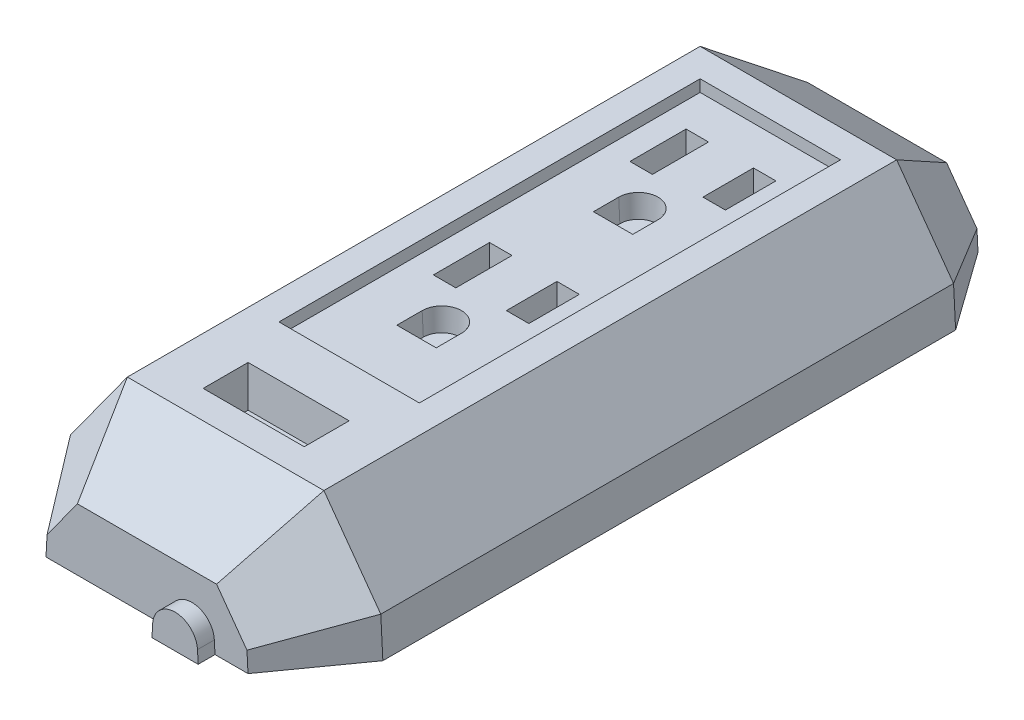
from build123d import *
from OCP.BRepFilletAPI import BRepFilletAPI_MakeChamfer

# Parameters (mm, degrees)
EXTRUDE1_DEPTH               = 130
CHAMFER1_SIZE                = 14
CHAMFER1_SIZE2               = 10
CHAMFER2_SIZE                = 10
CHAMFER2_SIZE2               = 14
EXTRUDE2_DEPTH               = 3
SKETCH3_W                    = 25
SKETCH3_H                    = 75
CUT_EXTRUDE1_DEPTH           = 2
CUT_EXTRUDE1_DRAFT           = -3
SKETCH4_W                    = 4
SKETCH4_H                    = 9
CUT_EXTRUDE2_DEPTH           = 4
CUT_EXTRUDE2_DRAFT           = -3
SKETCH4_H_2                  = 10
CUT_EXTRUDE2_PROFILE_2_DEPTH = 4
CUT_EXTRUDE2_PROFILE_2_DRAFT = -3
CUT_EXTRUDE2_PROFILE_3_DEPTH = 4
CUT_EXTRUDE2_PROFILE_3_DRAFT = -3
LPATTERN1_COPY_1_SKETCH_W    = 4
LPATTERN1_COPY_1_SKETCH_H    = 9
LPATTERN1_COPY_1_DEPTH       = 4
LPATTERN1_COPY_1_DRAFT       = -3
LPATTERN1_COPY_2_SKETCH_W    = 4
LPATTERN1_COPY_2_SKETCH_H    = 10
LPATTERN1_COPY_2_DEPTH       = 4
LPATTERN1_COPY_2_DRAFT       = -3
LPATTERN1_COPY_3_DEPTH       = 4
LPATTERN1_COPY_3_DRAFT       = -3
LPATTERN1_COPY_4_SKETCH_W    = 4
LPATTERN1_COPY_4_SKETCH_H    = 10
LPATTERN1_COPY_4_DEPTH       = 4
LPATTERN1_COPY_4_DRAFT       = -3
LPATTERN1_COPY_5_DEPTH       = 4
LPATTERN1_COPY_5_DRAFT       = -3
SKETCH5_W                    = 18
SKETCH5_H                    = 8
CUT_EXTRUDE3_DEPTH           = 7
CUT_EXTRUDE3_DRAFT           = -3


with BuildPart() as part:
    # Sketch1 → Extrude1 (new body)
    with BuildSketch(Plane.XY):
        Polygon((17.5, 21), (27.633145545, 7), (28, 0), (-28, 0), (-27.633145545, 7), (-17.5, 21), align=None)
    extrude(amount=EXTRUDE1_DEPTH)

    # Chamfer1: one chamfer whose edges measure the first distance from different faces: ONE call of the kernel's chamfer builder (chamfer() names one face for all edges)
    chamfer1_edges_1 = [part.edges().sort_by_distance(p)[0] for p in [
        (0, 21, 130),
    ]]
    chamfer1_side_1 = [part.faces().sort_by_distance(p)[0] for p in [
        (0, 21, 65),
    ]]
    chamfer1_edges_2 = [part.edges().sort_by_distance(p)[0] for p in [
        (-22.566572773, 14, 130),
    ]]
    chamfer1_side_2 = [part.faces().sort_by_distance(p)[0] for p in [
        (-22.566572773, 14, 65),
    ]]
    chamfer1_edges_3 = [part.edges().sort_by_distance(p)[0] for p in [
        (-27.816572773, 3.5, 130),
    ]]
    chamfer1_side_3 = [part.faces().sort_by_distance(p)[0] for p in [
        (-27.816572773, 3.5, 65),
    ]]
    chamfer1_edges_4 = [part.edges().sort_by_distance(p)[0] for p in [
        (27.816572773, 3.5, 130),
    ]]
    chamfer1_side_4 = [part.faces().sort_by_distance(p)[0] for p in [
        (27.816572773, 3.5, 65),
    ]]
    chamfer1_edges_5 = [part.edges().sort_by_distance(p)[0] for p in [
        (22.566572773, 14, 130),
    ]]
    chamfer1_side_5 = [part.faces().sort_by_distance(p)[0] for p in [
        (22.566572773, 14, 65),
    ]]
    chamfer1 = BRepFilletAPI_MakeChamfer(part.part.solid().wrapped)
    for e in chamfer1_edges_1:
        chamfer1.Add(CHAMFER1_SIZE, CHAMFER1_SIZE2, e.wrapped, chamfer1_side_1[0].wrapped)  # the first distance lies on this face
    for e in chamfer1_edges_2:
        chamfer1.Add(CHAMFER1_SIZE, CHAMFER1_SIZE2, e.wrapped, chamfer1_side_2[0].wrapped)  # the first distance lies on this face
    for e in chamfer1_edges_3:
        chamfer1.Add(CHAMFER1_SIZE, CHAMFER1_SIZE2, e.wrapped, chamfer1_side_3[0].wrapped)  # the first distance lies on this face
    for e in chamfer1_edges_4:
        chamfer1.Add(CHAMFER1_SIZE, CHAMFER1_SIZE2, e.wrapped, chamfer1_side_4[0].wrapped)  # the first distance lies on this face
    for e in chamfer1_edges_5:
        chamfer1.Add(CHAMFER1_SIZE, CHAMFER1_SIZE2, e.wrapped, chamfer1_side_5[0].wrapped)  # the first distance lies on this face
    add(Compound.cast(chamfer1.Shape()), mode=Mode.REPLACE)

    # Chamfer2
    chamfer2_edges = [part.edges().sort_by_distance(p)[0] for p in [
        (-27.816572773, 3.5, 0),
        (-22.566572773, 14, 0),
        (0, 21, 0),
        (22.566572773, 14, 0),
        (27.816572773, 3.5, 0),
    ]]
    chamfer2_side = [part.faces().sort_by_distance(p)[0] for p in [
        (0, 9.6691811, 0),
    ]]
    chamfer(chamfer2_edges, length=CHAMFER2_SIZE, length2=CHAMFER2_SIZE2, reference=chamfer2_side[0])

    # Sketch2 → Extrude2 (add)
    with BuildSketch(Plane(origin=(5.745184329, -1.894827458, 130), x_dir=(1, 0, 0), z_dir=(0, 0, 1))):
        with BuildLine():
            Line((-1.855489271, 1.894827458), (6.365120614, 1.894827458))
            Line((6.365120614, 1.894827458), (6.24933381, 4.104171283))
            ThreePointArc((6.24933381, 4.104171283), (2.254815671, 7.894827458), (-1.739702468, 4.104171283))
            Line((-1.739702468, 4.104171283), (-1.855489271, 1.894827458))
        make_face()
    extrude(amount=EXTRUDE2_DEPTH)


with BuildPart() as cut_extrude1_tool:
    # Sketch3 → Cut-Extrude1 (with draft: the straight prism first)
    with BuildSketch(Plane(origin=(3.492514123, 21, 107.578199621), x_dir=(1, 0, 0), z_dir=(0, 1, 0))):
        with Locations((-3.492514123, 51.078199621)):
            Rectangle(SKETCH3_W, SKETCH3_H)
    extrude(amount=-CUT_EXTRUDE1_DEPTH)
    # Cut-Extrude1: the draft: its side faces are tilted about the plane it starts from
    cut_extrude1_sides = [cut_extrude1_tool.faces().sort_by_distance(p)[0] for p in [
        (0, 20, 19),
        (-12.5, 20, 56.5),
        (0, 20, 94),
        (12.5, 20, 56.5),
    ]]
    draft(cut_extrude1_sides, Plane(origin=(3.492514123, 21, 107.578199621), x_dir=(1, 0, 0), z_dir=(0, 1, 0)), CUT_EXTRUDE1_DRAFT)


with BuildPart() as part_1:
    add(part.part)

    # Cut-Extrude1: cut by cut_extrude1_tool
    add(cut_extrude1_tool.part, mode=Mode.SUBTRACT)


with BuildPart() as cut_extrude2_tool:
    # Sketch4 → Cut-Extrude2 (with draft: the straight prism first)
    with BuildSketch(Plane(origin=(-3.08260661, 19, 40.468913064), x_dir=(-1, 0, 0), z_dir=(0, 1, 0))):
        with Locations((-9.08260661, -9.968913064)):
            Rectangle(SKETCH4_W, SKETCH4_H)
    extrude(amount=-CUT_EXTRUDE2_DEPTH)
    # Cut-Extrude2: the draft: its side faces are tilted about the plane it starts from
    cut_extrude2_sides = [cut_extrude2_tool.faces().sort_by_distance(p)[0] for p in [
        (4, 17, 30.5),
        (6, 17, 35),
        (8, 17, 30.5),
        (6, 17, 26),
    ]]
    draft(cut_extrude2_sides, Plane(origin=(-3.08260661, 19, 40.468913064), x_dir=(-1, 0, 0), z_dir=(0, 1, 0)), CUT_EXTRUDE2_DRAFT)


with BuildPart() as part_2:
    add(part_1.part)

    # Cut-Extrude2: cut by cut_extrude2_tool
    add(cut_extrude2_tool.part, mode=Mode.SUBTRACT)


with BuildPart() as cut_extrude2_profile_2_tool:
    # Sketch4 → Cut-Extrude2 profile 2 (with draft: the straight prism first)
    with BuildSketch(Plane(origin=(-3.08260661, 19, 40.468913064), x_dir=(-1, 0, 0), z_dir=(0, 1, 0))):
        with Locations((2.91739339, -9.468913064)):
            Rectangle(SKETCH4_W, SKETCH4_H_2)
    extrude(amount=-CUT_EXTRUDE2_PROFILE_2_DEPTH)
    # Cut-Extrude2 profile 2: the draft: its side faces are tilted about the plane it starts from
    cut_extrude2_profile_2_sides = [cut_extrude2_profile_2_tool.faces().sort_by_distance(p)[0] for p in [
        (-8, 17, 31),
        (-6, 17, 36),
        (-4, 17, 31),
        (-6, 17, 26),
    ]]
    draft(cut_extrude2_profile_2_sides, Plane(origin=(-3.08260661, 19, 40.468913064), x_dir=(-1, 0, 0), z_dir=(0, 1, 0)), CUT_EXTRUDE2_PROFILE_2_DRAFT)


with BuildPart() as part_3:
    add(part_2.part)

    # Cut-Extrude2 profile 2: cut by cut_extrude2_profile_2_tool
    add(cut_extrude2_profile_2_tool.part, mode=Mode.SUBTRACT)


with BuildPart() as cut_extrude2_profile_3_tool:
    # Sketch4 → Cut-Extrude2 profile 3 (with draft: the straight prism first)
    with BuildSketch(Plane(origin=(-3.08260661, 19, 40.468913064), x_dir=(-1, 0, 0), z_dir=(0, 1, 0))):
        with BuildLine():
            Line((-6.58260661, 6.531086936), (-6.58260661, 2.031086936))
            ThreePointArc((-6.58260661, 2.031086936), (-3.08260661, -1.468913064), (0.41739339, 2.031086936))
            Line((0.41739339, 2.031086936), (0.41739339, 6.531086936))
            Line((0.41739339, 6.531086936), (-6.58260661, 6.531086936))
        make_face()
    extrude(amount=-CUT_EXTRUDE2_PROFILE_3_DEPTH)
    # Cut-Extrude2 profile 3: the draft: its side faces are tilted about the plane it starts from
    cut_extrude2_profile_3_sides = [cut_extrude2_profile_3_tool.faces().sort_by_distance(p)[0] for p in [
        (-3.5, 17, 44.75),
        (0, 17, 47),
        (3.5, 17, 44.75),
        (0, 17, 39),
    ]]
    draft(cut_extrude2_profile_3_sides, Plane(origin=(-3.08260661, 19, 40.468913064), x_dir=(-1, 0, 0), z_dir=(0, 1, 0)), CUT_EXTRUDE2_PROFILE_3_DRAFT)


with BuildPart() as part_4:
    add(part_3.part)

    # Cut-Extrude2 profile 3: cut by cut_extrude2_profile_3_tool
    add(cut_extrude2_profile_3_tool.part, mode=Mode.SUBTRACT)


with BuildPart() as lpattern1_copy_1_tool:
    # LPattern1 copy 1 sketch → LPattern1 copy 1 (with draft: the straight prism first)
    with BuildSketch(Plane(origin=(-3.08260661, 19, 75.468913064), x_dir=(-1, 0, 0), z_dir=(0, 1, 0))):
        with Locations((-9.08260661, -9.968913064)):
            Rectangle(LPATTERN1_COPY_1_SKETCH_W, LPATTERN1_COPY_1_SKETCH_H)
    extrude(amount=-LPATTERN1_COPY_1_DEPTH)
    # LPattern1 copy 1: the draft: its side faces are tilted about the plane it starts from
    lpattern1_copy_1_sides = [lpattern1_copy_1_tool.faces().sort_by_distance(p)[0] for p in [
        (4, 17, 65.5),
        (6, 17, 70),
        (8, 17, 65.5),
        (6, 17, 61),
    ]]
    draft(lpattern1_copy_1_sides, Plane(origin=(-3.08260661, 19, 75.468913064), x_dir=(-1, 0, 0), z_dir=(0, 1, 0)), LPATTERN1_COPY_1_DRAFT)


with BuildPart() as part_5:
    add(part_4.part)

    # LPattern1 copy 1: cut by lpattern1_copy_1_tool
    add(lpattern1_copy_1_tool.part, mode=Mode.SUBTRACT)


with BuildPart() as lpattern1_copy_2_tool:
    # LPattern1 copy 2 sketch → LPattern1 copy 2 (with draft: the straight prism first)
    with BuildSketch(Plane(origin=(-3.08260661, 19, 75.468913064), x_dir=(-1, 0, 0), z_dir=(0, 1, 0))):
        with Locations((2.91739339, -9.468913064)):
            Rectangle(LPATTERN1_COPY_2_SKETCH_W, LPATTERN1_COPY_2_SKETCH_H)
    extrude(amount=-LPATTERN1_COPY_2_DEPTH)
    # LPattern1 copy 2: the draft: its side faces are tilted about the plane it starts from
    lpattern1_copy_2_sides = [lpattern1_copy_2_tool.faces().sort_by_distance(p)[0] for p in [
        (-8, 17, 66),
        (-6, 17, 71),
        (-4, 17, 66),
        (-6, 17, 61),
    ]]
    draft(lpattern1_copy_2_sides, Plane(origin=(-3.08260661, 19, 75.468913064), x_dir=(-1, 0, 0), z_dir=(0, 1, 0)), LPATTERN1_COPY_2_DRAFT)


with BuildPart() as part_6:
    add(part_5.part)

    # LPattern1 copy 2: cut by lpattern1_copy_2_tool
    add(lpattern1_copy_2_tool.part, mode=Mode.SUBTRACT)


with BuildPart() as lpattern1_copy_3_tool:
    # LPattern1 copy 3 sketch → LPattern1 copy 3 (with draft: the straight prism first)
    with BuildSketch(Plane(origin=(-3.08260661, 19, 75.468913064), x_dir=(-1, 0, 0), z_dir=(0, 1, 0))):
        with BuildLine():
            Line((-6.58260661, 6.531086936), (-6.58260661, 2.031086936))
            ThreePointArc((-6.58260661, 2.031086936), (-3.08260661, -1.468913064), (0.41739339, 2.031086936))
            Line((0.41739339, 2.031086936), (0.41739339, 6.531086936))
            Line((0.41739339, 6.531086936), (-6.58260661, 6.531086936))
        make_face()
    extrude(amount=-LPATTERN1_COPY_3_DEPTH)
    # LPattern1 copy 3: the draft: its side faces are tilted about the plane it starts from
    lpattern1_copy_3_sides = [lpattern1_copy_3_tool.faces().sort_by_distance(p)[0] for p in [
        (-3.5, 17, 79.75),
        (0, 17, 82),
        (3.5, 17, 79.75),
        (0, 17, 74),
    ]]
    draft(lpattern1_copy_3_sides, Plane(origin=(-3.08260661, 19, 75.468913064), x_dir=(-1, 0, 0), z_dir=(0, 1, 0)), LPATTERN1_COPY_3_DRAFT)


with BuildPart() as part_7:
    add(part_6.part)

    # LPattern1 copy 3: cut by lpattern1_copy_3_tool
    add(lpattern1_copy_3_tool.part, mode=Mode.SUBTRACT)


with BuildPart() as lpattern1_copy_4_tool:
    # LPattern1 copy 4 sketch → LPattern1 copy 4 (with draft: the straight prism first)
    with BuildSketch(Plane(origin=(-3.08260661, 19, 75.468913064), x_dir=(-1, 0, 0), z_dir=(0, 1, 0))):
        with Locations((2.91739339, -9.468913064)):
            Rectangle(LPATTERN1_COPY_4_SKETCH_W, LPATTERN1_COPY_4_SKETCH_H)
    extrude(amount=-LPATTERN1_COPY_4_DEPTH)
    # LPattern1 copy 4: the draft: its side faces are tilted about the plane it starts from
    lpattern1_copy_4_sides = [lpattern1_copy_4_tool.faces().sort_by_distance(p)[0] for p in [
        (-8, 17, 66),
        (-6, 17, 71),
        (-4, 17, 66),
        (-6, 17, 61),
    ]]
    draft(lpattern1_copy_4_sides, Plane(origin=(-3.08260661, 19, 75.468913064), x_dir=(-1, 0, 0), z_dir=(0, 1, 0)), LPATTERN1_COPY_4_DRAFT)


with BuildPart() as part_8:
    add(part_7.part)

    # LPattern1 copy 4: cut by lpattern1_copy_4_tool
    add(lpattern1_copy_4_tool.part, mode=Mode.SUBTRACT)


with BuildPart() as lpattern1_copy_5_tool:
    # LPattern1 copy 5 sketch → LPattern1 copy 5 (with draft: the straight prism first)
    with BuildSketch(Plane(origin=(-3.08260661, 19, 75.468913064), x_dir=(-1, 0, 0), z_dir=(0, 1, 0))):
        with BuildLine():
            Line((-6.58260661, 6.531086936), (-6.58260661, 2.031086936))
            ThreePointArc((-6.58260661, 2.031086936), (-3.08260661, -1.468913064), (0.41739339, 2.031086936))
            Line((0.41739339, 2.031086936), (0.41739339, 6.531086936))
            Line((0.41739339, 6.531086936), (-6.58260661, 6.531086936))
        make_face()
    extrude(amount=-LPATTERN1_COPY_5_DEPTH)
    # LPattern1 copy 5: the draft: its side faces are tilted about the plane it starts from
    lpattern1_copy_5_sides = [lpattern1_copy_5_tool.faces().sort_by_distance(p)[0] for p in [
        (-3.5, 17, 79.75),
        (0, 17, 82),
        (3.5, 17, 79.75),
        (0, 17, 74),
    ]]
    draft(lpattern1_copy_5_sides, Plane(origin=(-3.08260661, 19, 75.468913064), x_dir=(-1, 0, 0), z_dir=(0, 1, 0)), LPATTERN1_COPY_5_DRAFT)


with BuildPart() as part_9:
    add(part_8.part)

    # LPattern1 copy 5: cut by lpattern1_copy_5_tool
    add(lpattern1_copy_5_tool.part, mode=Mode.SUBTRACT)


with BuildPart() as cut_extrude3_tool:
    # Sketch5 → Cut-Extrude3 (with draft: the straight prism first)
    with BuildSketch(Plane(origin=(0.792567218, 21, 213.513140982), x_dir=(1, 0, 0), z_dir=(0, 1, 0))):
        with Locations((-0.792567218, 106.513140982)):
            Rectangle(SKETCH5_W, SKETCH5_H)
    extrude(amount=-CUT_EXTRUDE3_DEPTH)
    # Cut-Extrude3: the draft: its side faces are tilted about the plane it starts from
    cut_extrude3_sides = [cut_extrude3_tool.faces().sort_by_distance(p)[0] for p in [
        (0, 17.5, 111),
        (9, 17.5, 107),
        (0, 17.5, 103),
        (-9, 17.5, 107),
    ]]
    draft(cut_extrude3_sides, Plane(origin=(0.792567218, 21, 213.513140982), x_dir=(1, 0, 0), z_dir=(0, 1, 0)), CUT_EXTRUDE3_DRAFT)


with BuildPart() as part_10:
    add(part_9.part)

    # Cut-Extrude3: cut by cut_extrude3_tool
    add(cut_extrude3_tool.part, mode=Mode.SUBTRACT)


solid = part_10.part
